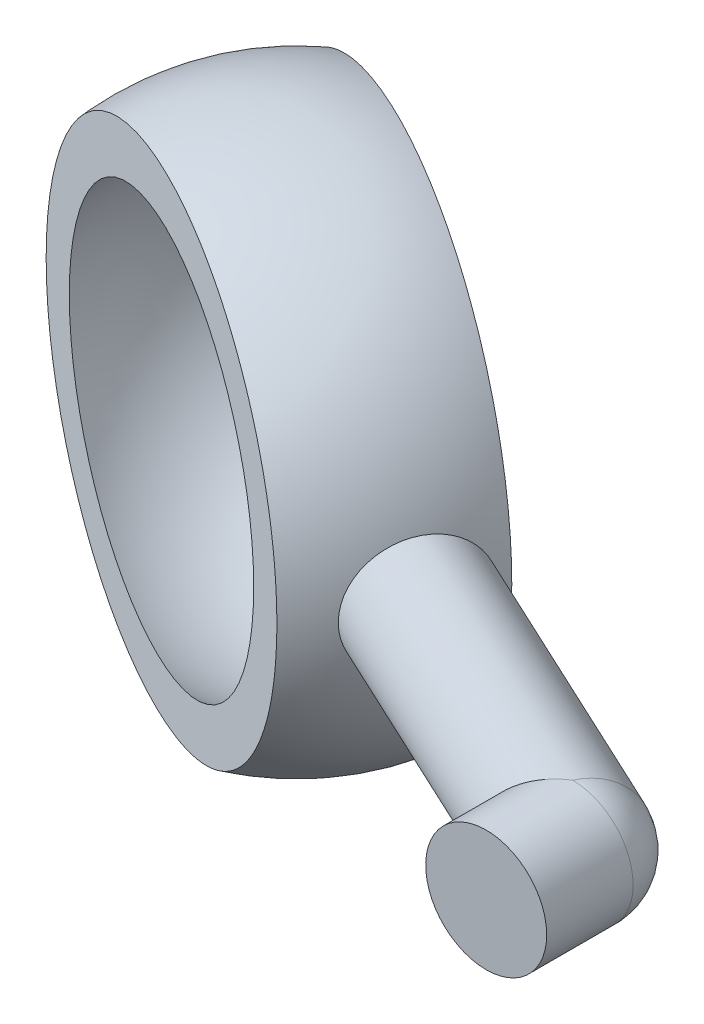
ISO-10303-21;
HEADER;
FILE_DESCRIPTION(('STEP AP214'),'2;1');
FILE_NAME('part.step','',(''),(''),'','','');
FILE_SCHEMA(('AUTOMOTIVE_DESIGN { 1 0 10303 214 1 1 1 1 }'));
ENDSEC;
DATA;
#1=APPLICATION_CONTEXT('core data for automotive mechanical design processes');
#2=APPLICATION_PROTOCOL_DEFINITION('international standard','automotive_design',2000,#1);
#3=PRODUCT_CONTEXT('',#1,'mechanical');
#4=PRODUCT('Part','Part','',(#3));
#5=PRODUCT_RELATED_PRODUCT_CATEGORY('part','',(#4));
#6=PRODUCT_DEFINITION_FORMATION('','',#4);
#7=PRODUCT_DEFINITION_CONTEXT('part definition',#1,'design');
#8=PRODUCT_DEFINITION('design','',#6,#7);
#9=PRODUCT_DEFINITION_SHAPE('','',#8);
#10=(LENGTH_UNIT() NAMED_UNIT(*) SI_UNIT(.MILLI.,.METRE.));
#11=(NAMED_UNIT(*) PLANE_ANGLE_UNIT() SI_UNIT($,.RADIAN.));
#12=(NAMED_UNIT(*) SI_UNIT($,.STERADIAN.) SOLID_ANGLE_UNIT());
#13=UNCERTAINTY_MEASURE_WITH_UNIT(LENGTH_MEASURE(1.E-05),#10,'distance_accuracy_value','');
#14=(GEOMETRIC_REPRESENTATION_CONTEXT(3) GLOBAL_UNCERTAINTY_ASSIGNED_CONTEXT((#13)) GLOBAL_UNIT_ASSIGNED_CONTEXT((#10,
#11,#12)) REPRESENTATION_CONTEXT('',''));
#15=CARTESIAN_POINT('',(0.,0.,0.));
#16=DIRECTION('',(0.,0.,1.));
#17=DIRECTION('',(1.,0.,0.));
#18=AXIS2_PLACEMENT_3D('',#15,#16,#17);
#19=CARTESIAN_POINT('',(0.,0.,0.));
#20=DIRECTION('',(0.90630778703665,0.,0.4226182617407));
#21=DIRECTION('',(0.4226182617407,0.,-0.90630778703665));
#22=AXIS2_PLACEMENT_3D('',#19,#20,#21);
#23=CYLINDRICAL_SURFACE('',#22,3.5);
#24=CARTESIAN_POINT('',(0.,0.,0.));
#25=DIRECTION('',(0.90630778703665,0.,0.4226182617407));
#26=DIRECTION('',(0.4226182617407,0.,-0.90630778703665));
#27=AXIS2_PLACEMENT_3D('',#24,#25,#26);
#28=CIRCLE('',#27,3.5);
#29=CARTESIAN_POINT('',(0.,-3.5,0.));
#30=VERTEX_POINT('',#29);
#31=CARTESIAN_POINT('',(0.,3.5,0.));
#32=VERTEX_POINT('',#31);
#33=EDGE_CURVE('E53',#30,#32,#28,.T.);
#34=ORIENTED_EDGE('',*,*,#33,.F.);
#35=CARTESIAN_POINT('',(0.,0.,0.));
#36=DIRECTION('',(-0.537299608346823,0.,-0.843391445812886));
#37=DIRECTION('',(0.843391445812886,0.,-0.537299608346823));
#38=AXIS2_PLACEMENT_3D('',#35,#36,#37);
#39=ELLIPSE('',#38,4.14991166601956,3.5);
#40=EDGE_CURVE('E48',#30,#32,#39,.T.);
#41=ORIENTED_EDGE('',*,*,#40,.T.);
#42=EDGE_LOOP('',(#34,#41));
#43=FACE_BOUND('',#42,.T.);
#44=CARTESIAN_POINT('',(-16.6887949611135,0.,-7.78211289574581));
#45=DIRECTION('',(-0.906307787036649,0.,-0.4226182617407));
#46=DIRECTION('',(-0.4226182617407,0.,0.90630778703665));
#47=AXIS2_PLACEMENT_3D('',#44,#45,#46);
#48=CIRCLE('',#47,3.5);
#49=CARTESIAN_POINT('',(-18.167958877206,0.,-4.61003564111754));
#50=VERTEX_POINT('',#49);
#51=EDGE_CURVE('E11',#50,#50,#48,.T.);
#52=ORIENTED_EDGE('',*,*,#51,.F.);
#53=EDGE_LOOP('',(#52));
#54=FACE_BOUND('',#53,.T.);
#55=ADVANCED_FACE('F32',(#43,#54),#23,.T.);
#56=CARTESIAN_POINT('',(0.,0.,5.));
#57=DIRECTION('',(0.,0.,-1.));
#58=DIRECTION('',(-1.,0.,0.));
#59=AXIS2_PLACEMENT_3D('',#56,#57,#58);
#60=CYLINDRICAL_SURFACE('',#59,3.5);
#61=CARTESIAN_POINT('',(0.,0.,5.));
#62=DIRECTION('',(0.,0.,1.));
#63=DIRECTION('',(1.,0.,0.));
#64=AXIS2_PLACEMENT_3D('',#61,#62,#63);
#65=CIRCLE('',#64,3.5);
#66=CARTESIAN_POINT('',(3.5,0.,5.));
#67=VERTEX_POINT('',#66);
#68=EDGE_CURVE('E41',#67,#67,#65,.T.);
#69=ORIENTED_EDGE('',*,*,#68,.F.);
#70=EDGE_LOOP('',(#69));
#71=FACE_BOUND('',#70,.T.);
#72=ORIENTED_EDGE('',*,*,#40,.F.);
#73=CARTESIAN_POINT('',(0.,0.,0.));
#74=DIRECTION('',(0.,0.,1.));
#75=DIRECTION('',(1.,0.,0.));
#76=AXIS2_PLACEMENT_3D('',#73,#74,#75);
#77=CIRCLE('',#76,3.5);
#78=EDGE_CURVE('E55',#30,#32,#77,.T.);
#79=ORIENTED_EDGE('',*,*,#78,.T.);
#80=EDGE_LOOP('',(#72,#79));
#81=FACE_BOUND('',#80,.T.);
#82=ADVANCED_FACE('F34',(#71,#81),#60,.T.);
#83=CARTESIAN_POINT('',(0.,0.,5.));
#84=DIRECTION('',(0.,0.,1.));
#85=DIRECTION('',(1.,0.,0.));
#86=AXIS2_PLACEMENT_3D('',#83,#84,#85);
#87=PLANE('',#86);
#88=ORIENTED_EDGE('',*,*,#68,.T.);
#89=EDGE_LOOP('',(#88));
#90=FACE_BOUND('',#89,.T.);
#91=ADVANCED_FACE('F99',(#90),#87,.T.);
#92=CARTESIAN_POINT('',(-29.9081569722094,0.,-13.9464026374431));
#93=DIRECTION('',(0.,0.,-1.));
#94=DIRECTION('',(-1.,0.,0.));
#95=AXIS2_PLACEMENT_3D('',#92,#93,#94);
#96=SPHERICAL_SURFACE('',#95,15.);
#97=CARTESIAN_POINT('',(-32.3962785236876,0.,-8.61060875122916));
#98=DIRECTION('',(0.4226182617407,0.,-0.90630778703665));
#99=DIRECTION('',(-0.90630778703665,0.,-0.4226182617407));
#100=AXIS2_PLACEMENT_3D('',#97,#98,#99);
#101=CIRCLE('',#100,13.7963239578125);
#102=CARTESIAN_POINT('',(-44.8999943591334,0.,-14.4411872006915));
#103=VERTEX_POINT('',#102);
#104=EDGE_CURVE('E69',#103,#103,#101,.T.);
#105=ORIENTED_EDGE('',*,*,#104,.T.);
#106=EDGE_LOOP('',(#105));
#107=FACE_BOUND('',#106,.T.);
#108=CARTESIAN_POINT('',(-28.1700959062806,0.,-17.6736866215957));
#109=DIRECTION('',(-0.4226182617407,0.,0.90630778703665));
#110=DIRECTION('',(0.90630778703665,0.,0.4226182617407));
#111=AXIS2_PLACEMENT_3D('',#108,#109,#110);
#112=CIRCLE('',#111,14.4252035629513);
#113=CARTESIAN_POINT('',(-15.0964215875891,0.,-11.5773321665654));
#114=VERTEX_POINT('',#113);
#115=EDGE_CURVE('E60',#114,#114,#112,.T.);
#116=ORIENTED_EDGE('',*,*,#115,.T.);
#117=EDGE_LOOP('',(#116));
#118=FACE_BOUND('',#117,.T.);
#119=ORIENTED_EDGE('',*,*,#51,.T.);
#120=EDGE_LOOP('',(#119));
#121=FACE_BOUND('',#120,.T.);
#122=ADVANCED_FACE('F91',(#107,#118,#121),#96,.T.);
#123=CARTESIAN_POINT('',(-1.94083028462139,-35.,-5.4427791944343));
#124=DIRECTION('',(-0.4226182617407,0.,0.90630778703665));
#125=DIRECTION('',(0.90630778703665,0.,0.4226182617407));
#126=AXIS2_PLACEMENT_3D('',#123,#124,#125);
#127=PLANE('',#126);
#128=CARTESIAN_POINT('',(-28.1700959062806,0.,-17.6736866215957));
#129=DIRECTION('',(-0.4226182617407,0.,0.90630778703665));
#130=DIRECTION('',(0.90630778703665,0.,0.4226182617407));
#131=AXIS2_PLACEMENT_3D('',#128,#129,#130);
#132=CIRCLE('',#131,11.804088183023);
#133=CARTESIAN_POINT('',(-38.8682329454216,0.,-22.6623098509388));
#134=VERTEX_POINT('',#133);
#135=EDGE_CURVE('E63',#134,#134,#132,.T.);
#136=ORIENTED_EDGE('',*,*,#135,.T.);
#137=EDGE_LOOP('',(#136));
#138=FACE_BOUND('',#137,.T.);
#139=ORIENTED_EDGE('',*,*,#115,.F.);
#140=EDGE_LOOP('',(#139));
#141=FACE_BOUND('',#140,.T.);
#142=ADVANCED_FACE('F84',(#138,#141),#127,.F.);
#143=CARTESIAN_POINT('',(-29.9081569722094,0.,-13.9464026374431));
#144=DIRECTION('',(0.,0.,-1.));
#145=DIRECTION('',(-1.,0.,0.));
#146=AXIS2_PLACEMENT_3D('',#143,#144,#145);
#147=SPHERICAL_SURFACE('',#146,12.5);
#148=CARTESIAN_POINT('',(-29.9081569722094,0.,-13.9464026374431));
#149=DIRECTION('',(0.4226182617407,0.,-0.90630778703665));
#150=DIRECTION('',(-0.90630778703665,0.,-0.4226182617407));
#151=AXIS2_PLACEMENT_3D('',#148,#149,#150);
#152=SPHERICAL_SURFACE('',#151,12.5);
#153=CARTESIAN_POINT('',(-32.3962785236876,0.,-8.61060875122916));
#154=DIRECTION('',(0.4226182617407,0.,-0.90630778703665));
#155=DIRECTION('',(-0.90630778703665,0.,-0.4226182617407));
#156=AXIS2_PLACEMENT_3D('',#153,#154,#155);
#157=CIRCLE('',#156,11.0267200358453);
#158=CARTESIAN_POINT('',(-42.3898807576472,0.,-13.2707020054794));
#159=VERTEX_POINT('',#158);
#160=EDGE_CURVE('E36',#159,#159,#157,.T.);
#161=CARTESIAN_POINT('',(-42.3898807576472,0.,-13.2707020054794));
#162=CARTESIAN_POINT('',(-42.395692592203,0.,-13.3780536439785));
#163=CARTESIAN_POINT('',(-42.4001188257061,0.,-13.4854802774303));
#164=CARTESIAN_POINT('',(-42.4061985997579,0.,-13.7004119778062));
#165=CARTESIAN_POINT('',(-42.4078521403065,0.,-13.8079170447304));
#166=CARTESIAN_POINT('',(-42.4083850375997,0.,-14.0229340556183));
#167=CARTESIAN_POINT('',(-42.4072643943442,0.,-14.1304459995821));
#168=CARTESIAN_POINT('',(-42.4022497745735,0.,-14.3454051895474));
#169=CARTESIAN_POINT('',(-42.3983557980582,0.,-14.4528524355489));
#170=CARTESIAN_POINT('',(-42.3877970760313,0.,-14.6676107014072));
#171=CARTESIAN_POINT('',(-42.3811323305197,0.,-14.7749217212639));
#172=CARTESIAN_POINT('',(-42.3650365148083,0.,-14.9893360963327));
#173=CARTESIAN_POINT('',(-42.3556054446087,0.,-15.0964394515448));
#174=CARTESIAN_POINT('',(-42.3339832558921,0.,-15.3103671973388));
#175=CARTESIAN_POINT('',(-42.321792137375,0.,-15.4171915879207));
#176=CARTESIAN_POINT('',(-42.2946579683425,0.,-15.6304902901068));
#177=CARTESIAN_POINT('',(-42.2797149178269,0.,-15.7369646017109));
#178=CARTESIAN_POINT('',(-42.2470868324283,0.,-15.9494922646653));
#179=CARTESIAN_POINT('',(-42.2294017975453,0.,-16.0555456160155));
#180=CARTESIAN_POINT('',(-42.1913015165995,0.,-16.267160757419));
#181=CARTESIAN_POINT('',(-42.1708862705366,0.,-16.3727225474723));
#182=CARTESIAN_POINT('',(-42.127339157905,0.,-16.5832842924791));
#183=CARTESIAN_POINT('',(-42.1042072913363,0.,-16.6882842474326));
#184=CARTESIAN_POINT('',(-42.0552423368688,0.,-16.8976524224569));
#185=CARTESIAN_POINT('',(-42.0294092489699,0.,-17.0020206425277));
#186=CARTESIAN_POINT('',(-41.9750590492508,0.,-17.210055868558));
#187=CARTESIAN_POINT('',(-41.9465419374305,0.,-17.3137228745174));
#188=CARTESIAN_POINT('',(-41.8868426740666,0.,-17.5202866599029));
#189=CARTESIAN_POINT('',(-41.8556605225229,0.,-17.623183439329));
#190=CARTESIAN_POINT('',(-41.7906519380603,0.,-17.8281382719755));
#191=CARTESIAN_POINT('',(-41.7568255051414,0.,-17.9301963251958));
#192=CARTESIAN_POINT('',(-41.6865508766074,0.,-18.133405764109));
#193=CARTESIAN_POINT('',(-41.6501026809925,0.,-18.2345571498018));
#194=CARTESIAN_POINT('',(-41.574608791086,0.,-18.4358859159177));
#195=CARTESIAN_POINT('',(-41.5355630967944,0.,-18.5360632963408));
#196=CARTESIAN_POINT('',(-41.4549002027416,0.,-18.7353773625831));
#197=CARTESIAN_POINT('',(-41.4132830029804,0.,-18.8345140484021));
#198=CARTESIAN_POINT('',(-41.3275048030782,0.,-19.031680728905));
#199=CARTESIAN_POINT('',(-41.2833438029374,0.,-19.1297107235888));
#200=CARTESIAN_POINT('',(-41.192507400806,0.,-19.3245987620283));
#201=CARTESIAN_POINT('',(-41.1458319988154,0.,-19.421456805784));
#202=CARTESIAN_POINT('',(-41.0499978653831,0.,-19.6139364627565));
#203=CARTESIAN_POINT('',(-41.0008391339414,0.,-19.7095580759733));
#204=CARTESIAN_POINT('',(-40.9000710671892,0.,-19.8995012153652));
#205=CARTESIAN_POINT('',(-40.8484617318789,0.,-19.9938227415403));
#206=CARTESIAN_POINT('',(-40.7428268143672,0.,-20.1811029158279));
#207=CARTESIAN_POINT('',(-40.6888012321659,0.,-20.2740615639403));
#208=CARTESIAN_POINT('',(-40.5783697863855,0.,-20.4585540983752));
#209=CARTESIAN_POINT('',(-40.5219639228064,0.,-20.5500879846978));
#210=CARTESIAN_POINT('',(-40.4068094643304,0.,-20.7316700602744));
#211=CARTESIAN_POINT('',(-40.3480608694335,0.,-20.8217182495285));
#212=CARTESIAN_POINT('',(-40.2282600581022,0.,-21.0002689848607));
#213=CARTESIAN_POINT('',(-40.1672078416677,0.,-21.0887715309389));
#214=CARTESIAN_POINT('',(-40.042840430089,0.,-21.2641720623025));
#215=CARTESIAN_POINT('',(-39.9795252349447,0.,-21.3510700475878));
#216=CARTESIAN_POINT('',(-39.850674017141,0.,-21.5232036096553));
#217=CARTESIAN_POINT('',(-39.7851379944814,0.,-21.6084391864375));
#218=CARTESIAN_POINT('',(-39.6518887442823,0.,-21.7771911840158));
#219=CARTESIAN_POINT('',(-39.5841755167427,0.,-21.8607076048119));
#220=CARTESIAN_POINT('',(-39.4466169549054,0.,-22.0259657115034));
#221=CARTESIAN_POINT('',(-39.3767716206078,0.,-22.1077073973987));
#222=CARTESIAN_POINT('',(-39.2349952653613,0.,-22.2693615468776));
#223=CARTESIAN_POINT('',(-39.1630642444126,0.,-22.3492740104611));
#224=CARTESIAN_POINT('',(-39.0171646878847,0.,-22.5072167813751));
#225=CARTESIAN_POINT('',(-38.9431961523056,0.,-22.5852470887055));
#226=CARTESIAN_POINT('',(-38.8682329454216,0.,-22.6623098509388));
#227=B_SPLINE_CURVE_WITH_KNOTS('',3,(#161,#162,#163,#164,#165,#166,#167,#168,#169,#170,#171,
#172,#173,#174,#175,#176,#177,#178,#179,#180,#181,#182,#183,#184,#185,#186,#187,#188,#189,#190,
#191,#192,#193,#194,#195,#196,#197,#198,#199,#200,#201,#202,#203,#204,#205,#206,#207,#208,#209,
#210,#211,#212,#213,#214,#215,#216,#217,#218,#219,#220,#221,#222,#223,#224,#225,#226),
.UNSPECIFIED.,.F.,.F.,(4,2,2,2,2,2,2,2,2,2,2,2,2,2,2,2,2,2,2,2,2,2,2,2,2,2,2,2,2,2,2,2,4),(0.,
0.322517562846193,0.645035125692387,0.967552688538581,1.29007025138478,1.61258781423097,
1.93510537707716,2.25762293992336,2.58014050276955,2.90265806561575,3.22517562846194,
3.54769319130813,3.87021075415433,4.19272831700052,4.51524587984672,4.83776344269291,
5.1602810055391,5.4827985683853,5.80531613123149,6.12783369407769,6.45035125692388,
6.77286881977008,7.09538638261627,7.41790394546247,7.74042150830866,8.06293907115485,
8.38545663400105,8.70797419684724,9.03049175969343,9.35300932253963,9.67552688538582,
9.99804444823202,10.3205620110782),.UNSPECIFIED.);
#228=EDGE_CURVE('BSEAM81',#159,#134,#227,.T.);
#229=ORIENTED_EDGE('',*,*,#160,.F.);
#230=ORIENTED_EDGE('',*,*,#135,.F.);
#231=ORIENTED_EDGE('',*,*,#228,.T.);
#232=ORIENTED_EDGE('',*,*,#228,.F.);
#233=EDGE_LOOP('',(#229,#231,#230,#232));
#234=FACE_BOUND('',#233,.T.);
#235=ADVANCED_FACE('F81',(#234),#152,.F.);
#236=CARTESIAN_POINT('',(-6.16701290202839,-35.,3.6202986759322));
#237=DIRECTION('',(0.4226182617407,0.,-0.90630778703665));
#238=DIRECTION('',(-0.90630778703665,0.,-0.4226182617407));
#239=AXIS2_PLACEMENT_3D('',#236,#237,#238);
#240=PLANE('',#239);
#241=ORIENTED_EDGE('',*,*,#160,.T.);
#242=EDGE_LOOP('',(#241));
#243=FACE_BOUND('',#242,.T.);
#244=ORIENTED_EDGE('',*,*,#104,.F.);
#245=EDGE_LOOP('',(#244));
#246=FACE_BOUND('',#245,.T.);
#247=ADVANCED_FACE('F78',(#243,#246),#240,.F.);
#248=CARTESIAN_POINT('',(0.,0.,0.));
#249=DIRECTION('',(0.,1.,0.));
#250=DIRECTION('',(-0.4226182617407,0.,0.906307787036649));
#251=AXIS2_PLACEMENT_3D('',#248,#249,#250);
#252=SPHERICAL_SURFACE('',#251,3.5);
#253=ORIENTED_EDGE('',*,*,#33,.T.);
#254=ORIENTED_EDGE('',*,*,#78,.F.);
#255=EDGE_LOOP('',(#253,#254));
#256=FACE_BOUND('',#255,.T.);
#257=ADVANCED_FACE('F59',(#256),#252,.T.);
#258=CLOSED_SHELL('',(#55,#82,#91,#122,#142,#235,#247,#257));
#259=MANIFOLD_SOLID_BREP('B2',#258);
#260=ADVANCED_BREP_SHAPE_REPRESENTATION('',(#18,#259),#14);
#261=SHAPE_DEFINITION_REPRESENTATION(#9,#260);
ENDSEC;
END-ISO-10303-21;
